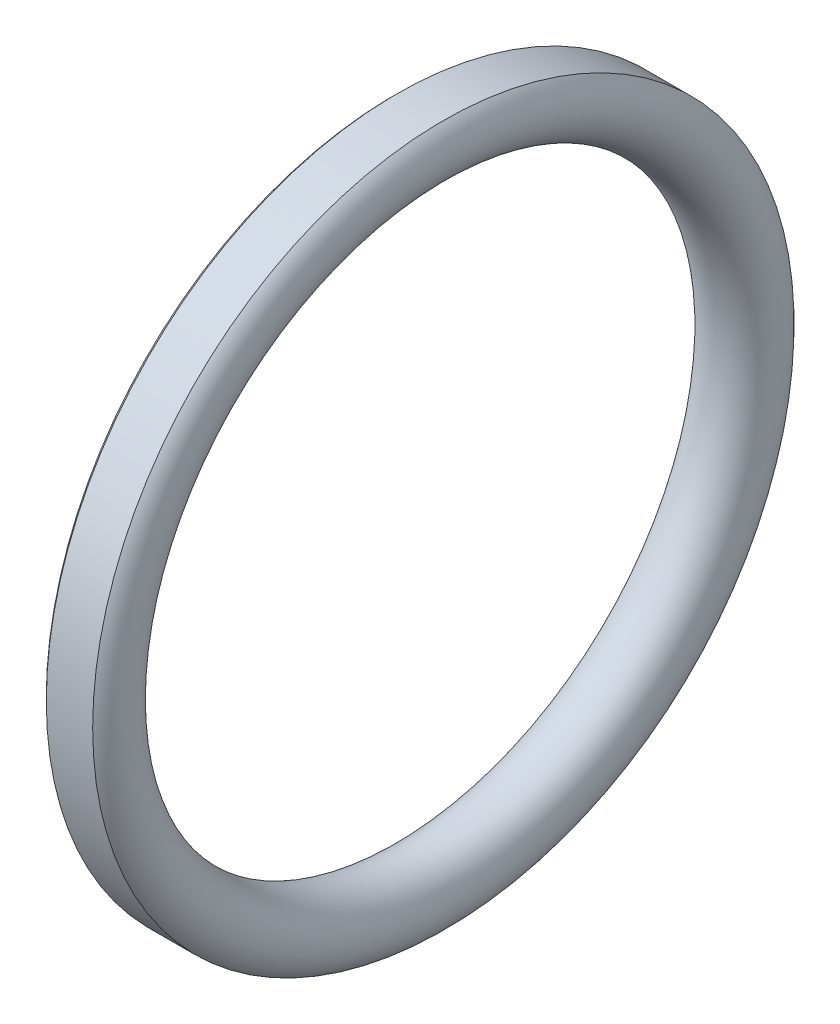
from build123d import *


with BuildPart() as part:
    # Esquisse1 → Base-R_volution (revolve)
    with BuildSketch(Plane.XY, mode=Mode.PRIVATE) as base_r_volution_sk:
        with BuildLine():
            Line((-0.661437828, 10), (0.661437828, 10))
            ThreePointArc((0.661437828, 10), (0, 8.25), (-0.661437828, 10))
        make_face()
    revolve(base_r_volution_sk.sketch.rotate(Axis((-18, 0, 0), (1, 0, 0)), 90), axis=Axis((-18, 0, 0), (1, 0, 0)))


solid = part.part
